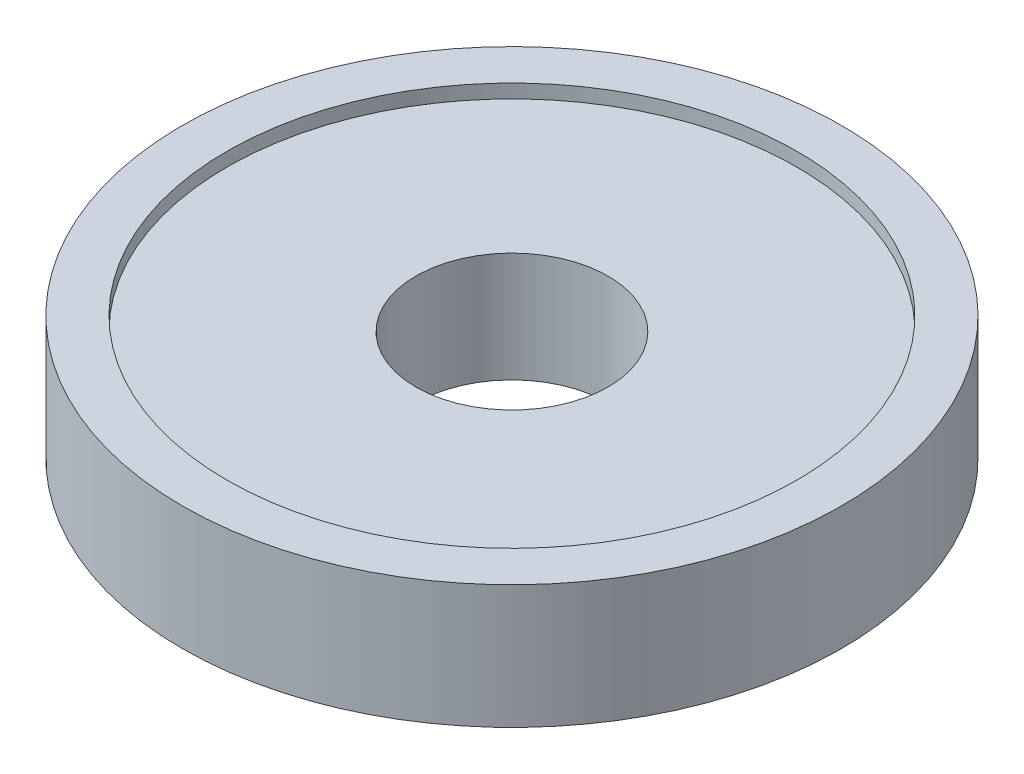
ISO-10303-21;
HEADER;
FILE_DESCRIPTION(('STEP AP214'),'2;1');
FILE_NAME('part.step','',(''),(''),'','','');
FILE_SCHEMA(('AUTOMOTIVE_DESIGN { 1 0 10303 214 1 1 1 1 }'));
ENDSEC;
DATA;
#1=APPLICATION_CONTEXT('core data for automotive mechanical design processes');
#2=APPLICATION_PROTOCOL_DEFINITION('international standard','automotive_design',2000,#1);
#3=PRODUCT_CONTEXT('',#1,'mechanical');
#4=PRODUCT('Part','Part','',(#3));
#5=PRODUCT_RELATED_PRODUCT_CATEGORY('part','',(#4));
#6=PRODUCT_DEFINITION_FORMATION('','',#4);
#7=PRODUCT_DEFINITION_CONTEXT('part definition',#1,'design');
#8=PRODUCT_DEFINITION('design','',#6,#7);
#9=PRODUCT_DEFINITION_SHAPE('','',#8);
#10=(LENGTH_UNIT() NAMED_UNIT(*) SI_UNIT(.MILLI.,.METRE.));
#11=(NAMED_UNIT(*) PLANE_ANGLE_UNIT() SI_UNIT($,.RADIAN.));
#12=(NAMED_UNIT(*) SI_UNIT($,.STERADIAN.) SOLID_ANGLE_UNIT());
#13=UNCERTAINTY_MEASURE_WITH_UNIT(LENGTH_MEASURE(1.E-05),#10,'distance_accuracy_value','');
#14=(GEOMETRIC_REPRESENTATION_CONTEXT(3) GLOBAL_UNCERTAINTY_ASSIGNED_CONTEXT((#13)) GLOBAL_UNIT_ASSIGNED_CONTEXT((#10,
#11,#12)) REPRESENTATION_CONTEXT('',''));
#15=CARTESIAN_POINT('',(0.,0.,0.));
#16=DIRECTION('',(0.,0.,1.));
#17=DIRECTION('',(1.,0.,0.));
#18=AXIS2_PLACEMENT_3D('',#15,#16,#17);
#19=CARTESIAN_POINT('',(0.,9.,0.));
#20=DIRECTION('',(0.,-1.,0.));
#21=DIRECTION('',(0.,0.,-1.));
#22=AXIS2_PLACEMENT_3D('',#19,#20,#21);
#23=CYLINDRICAL_SURFACE('',#22,14.);
#24=CARTESIAN_POINT('',(0.,-9.,0.));
#25=DIRECTION('',(0.,1.,0.));
#26=DIRECTION('',(0.,0.,1.));
#27=AXIS2_PLACEMENT_3D('',#24,#25,#26);
#28=CIRCLE('',#27,14.);
#29=CARTESIAN_POINT('',(0.,-9.,14.));
#30=VERTEX_POINT('',#29);
#31=EDGE_CURVE('E48',#30,#30,#28,.T.);
#32=ORIENTED_EDGE('',*,*,#31,.F.);
#33=EDGE_LOOP('',(#32));
#34=FACE_BOUND('',#33,.T.);
#35=CARTESIAN_POINT('',(0.,7.,0.));
#36=DIRECTION('',(0.,1.,0.));
#37=DIRECTION('',(0.,0.,1.));
#38=AXIS2_PLACEMENT_3D('',#35,#36,#37);
#39=CIRCLE('',#38,14.);
#40=CARTESIAN_POINT('',(0.,7.,14.));
#41=VERTEX_POINT('',#40);
#42=EDGE_CURVE('E39',#41,#41,#39,.T.);
#43=ORIENTED_EDGE('',*,*,#42,.T.);
#44=EDGE_LOOP('',(#43));
#45=FACE_BOUND('',#44,.T.);
#46=ADVANCED_FACE('F35',(#34,#45),#23,.F.);
#47=CARTESIAN_POINT('',(0.,9.,0.));
#48=DIRECTION('',(0.,1.,0.));
#49=DIRECTION('',(0.,0.,1.));
#50=AXIS2_PLACEMENT_3D('',#47,#48,#49);
#51=PLANE('',#50);
#52=CARTESIAN_POINT('',(0.,9.,0.));
#53=DIRECTION('',(0.,1.,0.));
#54=DIRECTION('',(0.,0.,1.));
#55=AXIS2_PLACEMENT_3D('',#52,#53,#54);
#56=CIRCLE('',#55,41.5);
#57=CARTESIAN_POINT('',(0.,9.,41.5));
#58=VERTEX_POINT('',#57);
#59=EDGE_CURVE('E52',#58,#58,#56,.T.);
#60=ORIENTED_EDGE('',*,*,#59,.F.);
#61=EDGE_LOOP('',(#60));
#62=FACE_BOUND('',#61,.T.);
#63=CARTESIAN_POINT('',(0.,9.,0.));
#64=DIRECTION('',(0.,1.,0.));
#65=DIRECTION('',(0.,0.,1.));
#66=AXIS2_PLACEMENT_3D('',#63,#64,#65);
#67=CIRCLE('',#66,48.);
#68=CARTESIAN_POINT('',(0.,9.,48.));
#69=VERTEX_POINT('',#68);
#70=EDGE_CURVE('E10',#69,#69,#67,.T.);
#71=ORIENTED_EDGE('',*,*,#70,.T.);
#72=EDGE_LOOP('',(#71));
#73=FACE_BOUND('',#72,.T.);
#74=ADVANCED_FACE('F73',(#62,#73),#51,.T.);
#75=CARTESIAN_POINT('',(0.,-9.,0.));
#76=DIRECTION('',(0.,1.,0.));
#77=DIRECTION('',(0.,0.,1.));
#78=AXIS2_PLACEMENT_3D('',#75,#76,#77);
#79=PLANE('',#78);
#80=CARTESIAN_POINT('',(0.,-9.,0.));
#81=DIRECTION('',(0.,1.,0.));
#82=DIRECTION('',(0.,0.,1.));
#83=AXIS2_PLACEMENT_3D('',#80,#81,#82);
#84=CIRCLE('',#83,48.);
#85=CARTESIAN_POINT('',(0.,-9.,48.));
#86=VERTEX_POINT('',#85);
#87=EDGE_CURVE('E43',#86,#86,#84,.T.);
#88=ORIENTED_EDGE('',*,*,#87,.F.);
#89=EDGE_LOOP('',(#88));
#90=FACE_BOUND('',#89,.T.);
#91=ORIENTED_EDGE('',*,*,#31,.T.);
#92=EDGE_LOOP('',(#91));
#93=FACE_BOUND('',#92,.T.);
#94=ADVANCED_FACE('F79',(#90,#93),#79,.F.);
#95=CARTESIAN_POINT('',(0.,9.,0.));
#96=DIRECTION('',(0.,-1.,0.));
#97=DIRECTION('',(0.,0.,-1.));
#98=AXIS2_PLACEMENT_3D('',#95,#96,#97);
#99=CYLINDRICAL_SURFACE('',#98,48.);
#100=ORIENTED_EDGE('',*,*,#70,.F.);
#101=EDGE_LOOP('',(#100));
#102=FACE_BOUND('',#101,.T.);
#103=ORIENTED_EDGE('',*,*,#87,.T.);
#104=EDGE_LOOP('',(#103));
#105=FACE_BOUND('',#104,.T.);
#106=ADVANCED_FACE('F37',(#102,#105),#99,.T.);
#107=CARTESIAN_POINT('',(0.,7.,0.));
#108=DIRECTION('',(0.,1.,0.));
#109=DIRECTION('',(0.,0.,1.));
#110=AXIS2_PLACEMENT_3D('',#107,#108,#109);
#111=CYLINDRICAL_SURFACE('',#110,41.5);
#112=CARTESIAN_POINT('',(0.,7.,0.));
#113=DIRECTION('',(0.,1.,0.));
#114=DIRECTION('',(0.,0.,1.));
#115=AXIS2_PLACEMENT_3D('',#112,#113,#114);
#116=CIRCLE('',#115,41.5);
#117=CARTESIAN_POINT('',(0.,7.,41.5));
#118=VERTEX_POINT('',#117);
#119=EDGE_CURVE('E55',#118,#118,#116,.T.);
#120=ORIENTED_EDGE('',*,*,#119,.F.);
#121=EDGE_LOOP('',(#120));
#122=FACE_BOUND('',#121,.T.);
#123=ORIENTED_EDGE('',*,*,#59,.T.);
#124=EDGE_LOOP('',(#123));
#125=FACE_BOUND('',#124,.T.);
#126=ADVANCED_FACE('F65',(#122,#125),#111,.F.);
#127=CARTESIAN_POINT('',(0.,7.,0.));
#128=DIRECTION('',(0.,1.,0.));
#129=DIRECTION('',(0.,0.,1.));
#130=AXIS2_PLACEMENT_3D('',#127,#128,#129);
#131=PLANE('',#130);
#132=ORIENTED_EDGE('',*,*,#42,.F.);
#133=EDGE_LOOP('',(#132));
#134=FACE_BOUND('',#133,.T.);
#135=ORIENTED_EDGE('',*,*,#119,.T.);
#136=EDGE_LOOP('',(#135));
#137=FACE_BOUND('',#136,.T.);
#138=ADVANCED_FACE('F63',(#134,#137),#131,.T.);
#139=CLOSED_SHELL('',(#46,#74,#94,#106,#126,#138));
#140=MANIFOLD_SOLID_BREP('B2',#139);
#141=ADVANCED_BREP_SHAPE_REPRESENTATION('',(#18,#140),#14);
#142=SHAPE_DEFINITION_REPRESENTATION(#9,#141);
ENDSEC;
END-ISO-10303-21;
